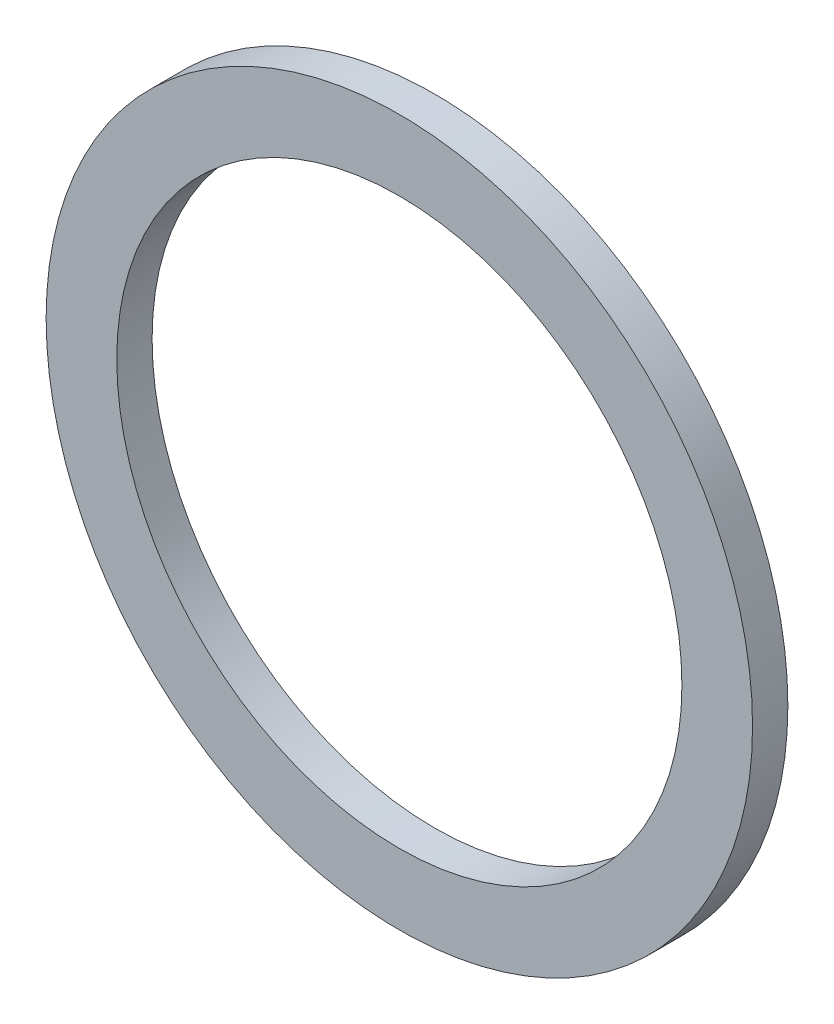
ISO-10303-21;
HEADER;
FILE_DESCRIPTION(('STEP AP214'),'2;1');
FILE_NAME('part.step','',(''),(''),'','','');
FILE_SCHEMA(('AUTOMOTIVE_DESIGN { 1 0 10303 214 1 1 1 1 }'));
ENDSEC;
DATA;
#1=APPLICATION_CONTEXT('core data for automotive mechanical design processes');
#2=APPLICATION_PROTOCOL_DEFINITION('international standard','automotive_design',2000,#1);
#3=PRODUCT_CONTEXT('',#1,'mechanical');
#4=PRODUCT('Part','Part','',(#3));
#5=PRODUCT_RELATED_PRODUCT_CATEGORY('part','',(#4));
#6=PRODUCT_DEFINITION_FORMATION('','',#4);
#7=PRODUCT_DEFINITION_CONTEXT('part definition',#1,'design');
#8=PRODUCT_DEFINITION('design','',#6,#7);
#9=PRODUCT_DEFINITION_SHAPE('','',#8);
#10=(LENGTH_UNIT() NAMED_UNIT(*) SI_UNIT(.MILLI.,.METRE.));
#11=(NAMED_UNIT(*) PLANE_ANGLE_UNIT() SI_UNIT($,.RADIAN.));
#12=(NAMED_UNIT(*) SI_UNIT($,.STERADIAN.) SOLID_ANGLE_UNIT());
#13=UNCERTAINTY_MEASURE_WITH_UNIT(LENGTH_MEASURE(1.E-05),#10,'distance_accuracy_value','');
#14=(GEOMETRIC_REPRESENTATION_CONTEXT(3) GLOBAL_UNCERTAINTY_ASSIGNED_CONTEXT((#13)) GLOBAL_UNIT_ASSIGNED_CONTEXT((#10,
#11,#12)) REPRESENTATION_CONTEXT('',''));
#15=CARTESIAN_POINT('',(0.,0.,0.));
#16=DIRECTION('',(0.,0.,1.));
#17=DIRECTION('',(1.,0.,0.));
#18=AXIS2_PLACEMENT_3D('',#15,#16,#17);
#19=CARTESIAN_POINT('',(0.,0.,5.));
#20=DIRECTION('',(0.,0.,1.));
#21=DIRECTION('',(1.,0.,0.));
#22=AXIS2_PLACEMENT_3D('',#19,#20,#21);
#23=PLANE('',#22);
#24=CARTESIAN_POINT('',(0.,0.,5.));
#25=DIRECTION('',(0.,0.,1.));
#26=DIRECTION('',(1.,0.,0.));
#27=AXIS2_PLACEMENT_3D('',#24,#25,#26);
#28=CIRCLE('',#27,50.);
#29=CARTESIAN_POINT('',(50.,0.,5.));
#30=VERTEX_POINT('',#29);
#31=EDGE_CURVE('E10',#30,#30,#28,.T.);
#32=ORIENTED_EDGE('',*,*,#31,.T.);
#33=EDGE_LOOP('',(#32));
#34=FACE_BOUND('',#33,.T.);
#35=CARTESIAN_POINT('',(0.,0.,5.));
#36=DIRECTION('',(0.,0.,1.));
#37=DIRECTION('',(1.,0.,0.));
#38=AXIS2_PLACEMENT_3D('',#35,#36,#37);
#39=CIRCLE('',#38,40.);
#40=CARTESIAN_POINT('',(40.,0.,5.));
#41=VERTEX_POINT('',#40);
#42=EDGE_CURVE('E40',#41,#41,#39,.T.);
#43=ORIENTED_EDGE('',*,*,#42,.F.);
#44=EDGE_LOOP('',(#43));
#45=FACE_BOUND('',#44,.T.);
#46=ADVANCED_FACE('F29',(#34,#45),#23,.T.);
#47=CARTESIAN_POINT('',(0.,0.,0.));
#48=DIRECTION('',(0.,0.,1.));
#49=DIRECTION('',(1.,0.,0.));
#50=AXIS2_PLACEMENT_3D('',#47,#48,#49);
#51=PLANE('',#50);
#52=CARTESIAN_POINT('',(0.,0.,0.));
#53=DIRECTION('',(0.,0.,1.));
#54=DIRECTION('',(1.,0.,0.));
#55=AXIS2_PLACEMENT_3D('',#52,#53,#54);
#56=CIRCLE('',#55,50.);
#57=CARTESIAN_POINT('',(50.,0.,0.));
#58=VERTEX_POINT('',#57);
#59=EDGE_CURVE('E36',#58,#58,#56,.T.);
#60=ORIENTED_EDGE('',*,*,#59,.F.);
#61=EDGE_LOOP('',(#60));
#62=FACE_BOUND('',#61,.T.);
#63=CARTESIAN_POINT('',(0.,0.,0.));
#64=DIRECTION('',(0.,0.,1.));
#65=DIRECTION('',(1.,0.,0.));
#66=AXIS2_PLACEMENT_3D('',#63,#64,#65);
#67=CIRCLE('',#66,40.);
#68=CARTESIAN_POINT('',(40.,0.,0.));
#69=VERTEX_POINT('',#68);
#70=EDGE_CURVE('E44',#69,#69,#67,.T.);
#71=ORIENTED_EDGE('',*,*,#70,.T.);
#72=EDGE_LOOP('',(#71));
#73=FACE_BOUND('',#72,.T.);
#74=ADVANCED_FACE('F50',(#62,#73),#51,.F.);
#75=CARTESIAN_POINT('',(0.,0.,5.));
#76=DIRECTION('',(0.,0.,-1.));
#77=DIRECTION('',(-1.,0.,0.));
#78=AXIS2_PLACEMENT_3D('',#75,#76,#77);
#79=CYLINDRICAL_SURFACE('',#78,50.);
#80=ORIENTED_EDGE('',*,*,#31,.F.);
#81=EDGE_LOOP('',(#80));
#82=FACE_BOUND('',#81,.T.);
#83=ORIENTED_EDGE('',*,*,#59,.T.);
#84=EDGE_LOOP('',(#83));
#85=FACE_BOUND('',#84,.T.);
#86=ADVANCED_FACE('F31',(#82,#85),#79,.T.);
#87=CARTESIAN_POINT('',(0.,0.,5.));
#88=DIRECTION('',(0.,0.,-1.));
#89=DIRECTION('',(-1.,0.,0.));
#90=AXIS2_PLACEMENT_3D('',#87,#88,#89);
#91=CYLINDRICAL_SURFACE('',#90,40.);
#92=ORIENTED_EDGE('',*,*,#42,.T.);
#93=EDGE_LOOP('',(#92));
#94=FACE_BOUND('',#93,.T.);
#95=ORIENTED_EDGE('',*,*,#70,.F.);
#96=EDGE_LOOP('',(#95));
#97=FACE_BOUND('',#96,.T.);
#98=ADVANCED_FACE('F52',(#94,#97),#91,.F.);
#99=CLOSED_SHELL('',(#46,#74,#86,#98));
#100=MANIFOLD_SOLID_BREP('B2',#99);
#101=ADVANCED_BREP_SHAPE_REPRESENTATION('',(#18,#100),#14);
#102=SHAPE_DEFINITION_REPRESENTATION(#9,#101);
ENDSEC;
END-ISO-10303-21;
